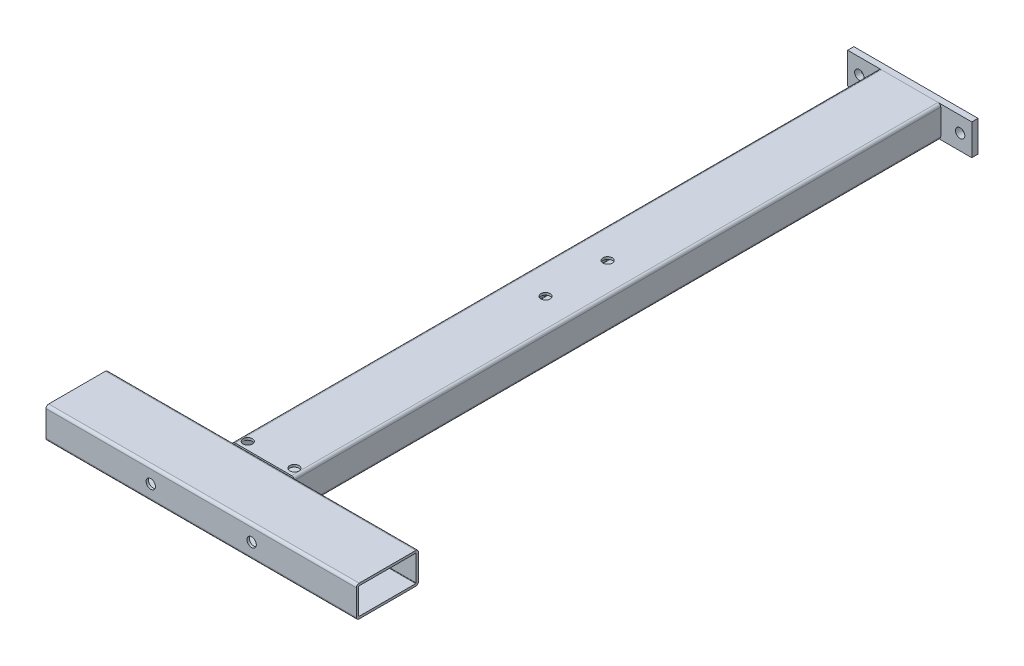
from build123d import *

# Parameters (mm, degrees)
EL_MENT_M_CANO_SOUD_1_DEPTH   = 400
EL_MENT_M_CANO_SOUD_1_2_DEPTH = 874
ESQUISSE3_W                   = 160
ESQUISSE3_H                   = 40
BOSS_EXTRU_1_DEPTH            = 8
ESQUISSE4_R                   = 6
ENL_V_MAT_EXTRU_1_DEPTH       = 3
ESQUISSE5_R                   = 6
ENL_V_MAT_EXTRU_2_DEPTH       = 905.301387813
ESQUISSE6_R                   = 6
ENL_V_MAT_EXTRU_3_DEPTH       = 943.67756948


with BuildPart() as part:
    # Sketch1 → El_ment m_cano-soud_1 (new body)
    with BuildSketch(Plane(origin=(-200, 0, 0), x_dir=(0, 0, -1), z_dir=(1, 0, 0))):
        with BuildLine():
            Line((-36.5, -20), (36.5, -20))
            ThreePointArc((36.5, -20), (38.974873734, -18.974873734), (40, -16.5))
            Line((40, -16.5), (40, 16.5))
            ThreePointArc((40, 16.5), (38.974873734, 18.974873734), (36.5, 20))
            Line((36.5, 20), (-36.5, 20))
            ThreePointArc((-36.5, 20), (-38.974873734, 18.974873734), (-40, 16.5))
            Line((-40, 16.5), (-40, -16.5))
            ThreePointArc((-40, -16.5), (-38.974873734, -18.974873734), (-36.5, -20))
        make_face()
        with BuildLine():
            Line((-36.5, -17), (36.5, -17))
            ThreePointArc((36.5, -17), (36.853553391, -16.853553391), (37, -16.5))
            Line((37, -16.5), (37, 16.5))
            ThreePointArc((37, 16.5), (36.853553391, 16.853553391), (36.5, 17))
            Line((36.5, 17), (-36.5, 17))
            ThreePointArc((-36.5, 17), (-36.853553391, 16.853553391), (-37, 16.5))
            Line((-37, 16.5), (-37, -16.5))
            ThreePointArc((-37, -16.5), (-36.853553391, -16.853553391), (-36.5, -17))
        make_face(mode=Mode.SUBTRACT)
    extrude(amount=EL_MENT_M_CANO_SOUD_1_DEPTH)


with BuildPart() as body_2:
    # Sketch1 on segment 2 (on carried to segment 2) → El_ment m_cano-soud_1 2 (new body)
    with BuildSketch(Plane(origin=(0, 0, 1), x_dir=(-1, 0, 0), z_dir=(0, 0, -1))):
        with BuildLine():
            Line((-36.5, -20), (36.5, -20))
            ThreePointArc((36.5, -20), (38.974873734, -18.974873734), (40, -16.5))
            Line((40, -16.5), (40, 16.5))
            ThreePointArc((40, 16.5), (38.974873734, 18.974873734), (36.5, 20))
            Line((36.5, 20), (-36.5, 20))
            ThreePointArc((-36.5, 20), (-38.974873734, 18.974873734), (-40, 16.5))
            Line((-40, 16.5), (-40, -16.5))
            ThreePointArc((-40, -16.5), (-38.974873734, -18.974873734), (-36.5, -20))
        make_face()
        with BuildLine():
            Line((-36.5, -17), (36.5, -17))
            ThreePointArc((36.5, -17), (36.853553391, -16.853553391), (37, -16.5))
            Line((37, -16.5), (37, 16.5))
            ThreePointArc((37, 16.5), (36.853553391, 16.853553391), (36.5, 17))
            Line((36.5, 17), (-36.5, 17))
            ThreePointArc((-36.5, 17), (-36.853553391, 16.853553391), (-37, 16.5))
            Line((-37, 16.5), (-37, -16.5))
            ThreePointArc((-37, -16.5), (-36.853553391, -16.853553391), (-36.5, -17))
        make_face(mode=Mode.SUBTRACT)
    extrude(amount=EL_MENT_M_CANO_SOUD_1_2_DEPTH)

    # El_ment m_cano-soud_1 2 end butt 1
    split(bisect_by=Plane.YX.offset(40), keep=Keep.TOP)

    # Esquisse4 → Enl_v. mat.-Extru.1 (cut)
    with BuildSketch(Plane(origin=(0, 20, 0), x_dir=(1, 0, 0), z_dir=(0, 1, 0))):
        with Locations(Location((30, 50, 0), (0, 0, 270))):
            Circle(ESQUISSE4_R)
        with Locations(Location((-30, 50, 0), (0, 0, 270))):
            Circle(ESQUISSE4_R)
    extrude(amount=-ENL_V_MAT_EXTRU_1_DEPTH, mode=Mode.SUBTRACT)

    # Esquisse5 → Enl_v. mat.-Extru.2 (cut, through all)
    with BuildSketch(Plane(origin=(0, 20, 0), x_dir=(1, 0, 0), z_dir=(0, 1, 0))):
        with Locations(Location((0, 483.77, 0), (0, 0, 270))):
            Circle(ESQUISSE5_R)
        with Locations(Location((0, 403.77, 0), (0, 0, 270))):
            Circle(ESQUISSE5_R)
    extrude(amount=-ENL_V_MAT_EXTRU_2_DEPTH, mode=Mode.SUBTRACT)


with BuildPart() as body_3:
    # Esquisse3 → Boss.-Extru.1 (new body)
    with BuildSketch(Plane(origin=(0, 0, -873), x_dir=(-1, 0, 0), z_dir=(0, 0, -1))):
        Rectangle(ESQUISSE3_W, ESQUISSE3_H)
    extrude(amount=BOSS_EXTRU_1_DEPTH)


with BuildPart() as enl_v_mat_extru_3_tool:
    # Esquisse6 → Enl_v. mat.-Extru.3 (new, through all)
    with BuildSketch(Plane.XY.offset(40)):
        with Locations((-65, 0)):
            Circle(ESQUISSE6_R)
        with Locations((65, 0)):
            Circle(ESQUISSE6_R)
    extrude(amount=-ENL_V_MAT_EXTRU_3_DEPTH)


with BuildPart() as part_1:
    add(part.part)

    # Enl_v. mat.-Extru.3: cut by enl_v_mat_extru_3_tool
    add(enl_v_mat_extru_3_tool.part, mode=Mode.SUBTRACT)


with BuildPart() as body_3_1:
    add(body_3.part)

    # Enl_v. mat.-Extru.3: cut by enl_v_mat_extru_3_tool
    add(enl_v_mat_extru_3_tool.part, mode=Mode.SUBTRACT)


solid = Compound([body_2.part, part_1.part, body_3_1.part])
